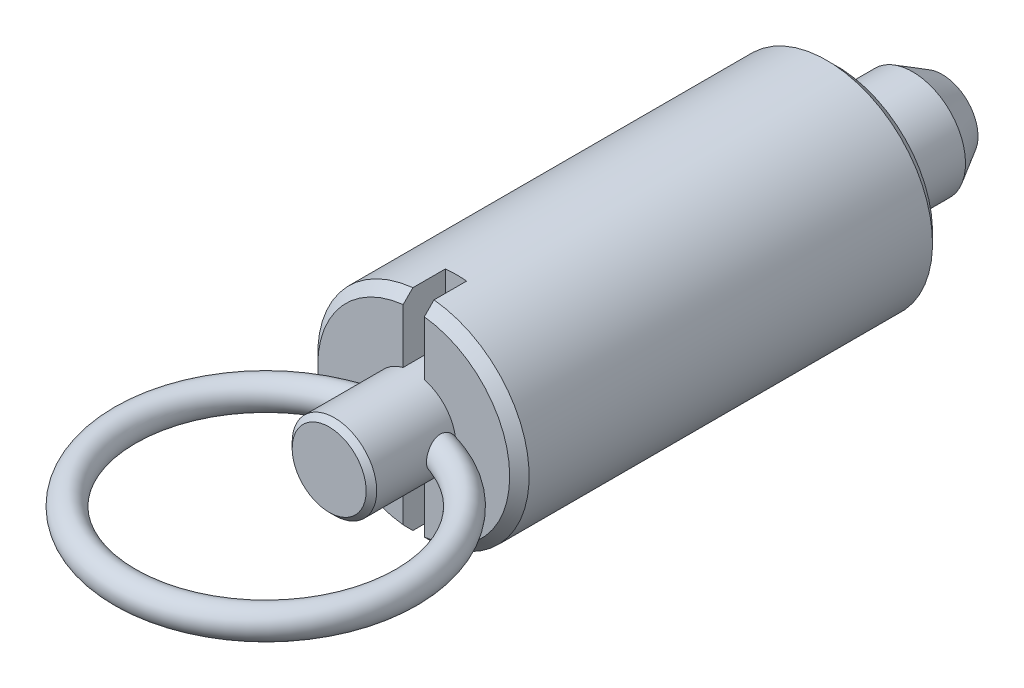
ISO-10303-21;
HEADER;
FILE_DESCRIPTION(('STEP AP214'),'2;1');
FILE_NAME('part.step','',(''),(''),'','','');
FILE_SCHEMA(('AUTOMOTIVE_DESIGN { 1 0 10303 214 1 1 1 1 }'));
ENDSEC;
DATA;
#1=APPLICATION_CONTEXT('core data for automotive mechanical design processes');
#2=APPLICATION_PROTOCOL_DEFINITION('international standard','automotive_design',2000,#1);
#3=PRODUCT_CONTEXT('',#1,'mechanical');
#4=PRODUCT('Part','Part','',(#3));
#5=PRODUCT_RELATED_PRODUCT_CATEGORY('part','',(#4));
#6=PRODUCT_DEFINITION_FORMATION('','',#4);
#7=PRODUCT_DEFINITION_CONTEXT('part definition',#1,'design');
#8=PRODUCT_DEFINITION('design','',#6,#7);
#9=PRODUCT_DEFINITION_SHAPE('','',#8);
#10=(LENGTH_UNIT() NAMED_UNIT(*) SI_UNIT(.MILLI.,.METRE.));
#11=(NAMED_UNIT(*) PLANE_ANGLE_UNIT() SI_UNIT($,.RADIAN.));
#12=(NAMED_UNIT(*) SI_UNIT($,.STERADIAN.) SOLID_ANGLE_UNIT());
#13=UNCERTAINTY_MEASURE_WITH_UNIT(LENGTH_MEASURE(1.E-05),#10,'distance_accuracy_value','');
#14=(GEOMETRIC_REPRESENTATION_CONTEXT(3) GLOBAL_UNCERTAINTY_ASSIGNED_CONTEXT((#13)) GLOBAL_UNIT_ASSIGNED_CONTEXT((#10,
#11,#12)) REPRESENTATION_CONTEXT('',''));
#15=CARTESIAN_POINT('',(0.,0.,0.));
#16=DIRECTION('',(0.,0.,1.));
#17=DIRECTION('',(1.,0.,0.));
#18=AXIS2_PLACEMENT_3D('',#15,#16,#17);
#19=CARTESIAN_POINT('',(3.38341924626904,0.,-10.));
#20=DIRECTION('',(0.,0.,1.));
#21=DIRECTION('',(0.,-1.,0.));
#22=AXIS2_PLACEMENT_3D('',#19,#20,#21);
#23=PLANE('',#22);
#24=CARTESIAN_POINT('',(0.,0.,-9.99999999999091));
#25=DIRECTION('',(0.,0.,1.));
#26=DIRECTION('',(0.,-1.,0.));
#27=AXIS2_PLACEMENT_3D('',#24,#25,#26);
#28=CIRCLE('',#27,3.3834192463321);
#29=CARTESIAN_POINT('',(0.,-3.3834192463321,-9.99999999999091));
#30=VERTEX_POINT('',#29);
#31=EDGE_CURVE('E294',#30,#30,#28,.T.);
#32=ORIENTED_EDGE('',*,*,#31,.F.);
#33=EDGE_LOOP('',(#32));
#34=FACE_BOUND('',#33,.T.);
#35=ADVANCED_FACE('F14',(#34),#23,.F.);
#36=CARTESIAN_POINT('',(0.,0.,-7.20000000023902));
#37=DIRECTION('',(0.,0.,1.));
#38=DIRECTION('',(0.,-1.,0.));
#39=AXIS2_PLACEMENT_3D('',#36,#37,#38);
#40=CONICAL_SURFACE('',#39,4.99999999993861,0.523598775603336);
#41=CARTESIAN_POINT('',(0.,0.,-7.2));
#42=DIRECTION('',(0.,0.,1.));
#43=DIRECTION('',(0.,-1.,0.));
#44=AXIS2_PLACEMENT_3D('',#41,#42,#43);
#45=CIRCLE('',#44,5.);
#46=CARTESIAN_POINT('',(0.,-5.,-7.2));
#47=VERTEX_POINT('',#46);
#48=EDGE_CURVE('E338',#47,#47,#45,.T.);
#49=ORIENTED_EDGE('',*,*,#48,.F.);
#50=EDGE_LOOP('',(#49));
#51=FACE_BOUND('',#50,.T.);
#52=ORIENTED_EDGE('',*,*,#31,.T.);
#53=EDGE_LOOP('',(#52));
#54=FACE_BOUND('',#53,.T.);
#55=ADVANCED_FACE('F198',(#51,#54),#40,.T.);
#56=CARTESIAN_POINT('',(0.,0.,-10.));
#57=DIRECTION('',(0.,0.,1.));
#58=DIRECTION('',(0.,-1.,0.));
#59=AXIS2_PLACEMENT_3D('',#56,#57,#58);
#60=CYLINDRICAL_SURFACE('',#59,5.);
#61=CARTESIAN_POINT('',(0.,0.,0.));
#62=DIRECTION('',(0.,0.,1.));
#63=DIRECTION('',(0.,-1.,0.));
#64=AXIS2_PLACEMENT_3D('',#61,#62,#63);
#65=CIRCLE('',#64,5.);
#66=CARTESIAN_POINT('',(0.,-5.,0.));
#67=VERTEX_POINT('',#66);
#68=EDGE_CURVE('E335',#67,#67,#65,.F.);
#69=ORIENTED_EDGE('',*,*,#68,.T.);
#70=EDGE_LOOP('',(#69));
#71=FACE_BOUND('',#70,.T.);
#72=ORIENTED_EDGE('',*,*,#48,.T.);
#73=EDGE_LOOP('',(#72));
#74=FACE_BOUND('',#73,.T.);
#75=ADVANCED_FACE('F194',(#71,#74),#60,.T.);
#76=CARTESIAN_POINT('',(9.08,0.,0.));
#77=DIRECTION('',(0.,0.,1.));
#78=DIRECTION('',(0.,-1.,0.));
#79=AXIS2_PLACEMENT_3D('',#76,#77,#78);
#80=PLANE('',#79);
#81=CARTESIAN_POINT('',(0.,0.,0.));
#82=DIRECTION('',(0.,0.,1.));
#83=DIRECTION('',(0.,-1.,0.));
#84=AXIS2_PLACEMENT_3D('',#81,#82,#83);
#85=CIRCLE('',#84,9.08);
#86=CARTESIAN_POINT('',(0.,-9.08,0.));
#87=VERTEX_POINT('',#86);
#88=EDGE_CURVE('E24',#87,#87,#85,.T.);
#89=ORIENTED_EDGE('',*,*,#88,.F.);
#90=EDGE_LOOP('',(#89));
#91=FACE_BOUND('',#90,.T.);
#92=ORIENTED_EDGE('',*,*,#68,.F.);
#93=EDGE_LOOP('',(#92));
#94=FACE_BOUND('',#93,.T.);
#95=ADVANCED_FACE('F187',(#91,#94),#80,.F.);
#96=CARTESIAN_POINT('',(0.,0.,0.920000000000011));
#97=DIRECTION('',(0.,0.,1.));
#98=DIRECTION('',(0.,-1.,0.));
#99=AXIS2_PLACEMENT_3D('',#96,#97,#98);
#100=CONICAL_SURFACE('',#99,10.,0.785398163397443);
#101=CARTESIAN_POINT('',(0.,0.,0.920000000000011));
#102=DIRECTION('',(0.,0.,1.));
#103=DIRECTION('',(0.,-1.,0.));
#104=AXIS2_PLACEMENT_3D('',#101,#102,#103);
#105=CIRCLE('',#104,10.);
#106=CARTESIAN_POINT('',(0.,-10.,0.920000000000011));
#107=VERTEX_POINT('',#106);
#108=EDGE_CURVE('E9',#107,#107,#105,.T.);
#109=ORIENTED_EDGE('',*,*,#108,.F.);
#110=EDGE_LOOP('',(#109));
#111=FACE_BOUND('',#110,.T.);
#112=ORIENTED_EDGE('',*,*,#88,.T.);
#113=EDGE_LOOP('',(#112));
#114=FACE_BOUND('',#113,.T.);
#115=ADVANCED_FACE('F178',(#111,#114),#100,.T.);
#116=CARTESIAN_POINT('',(0.,0.,-10.));
#117=DIRECTION('',(0.,0.,1.));
#118=DIRECTION('',(0.,-1.,0.));
#119=AXIS2_PLACEMENT_3D('',#116,#117,#118);
#120=CYLINDRICAL_SURFACE('',#119,10.);
#121=ORIENTED_EDGE('',*,*,#108,.T.);
#122=EDGE_LOOP('',(#121));
#123=FACE_BOUND('',#122,.T.);
#124=DIRECTION('',(0.,0.,1.));
#125=VECTOR('',#124,1.);
#126=CARTESIAN_POINT('',(-1.,9.9498743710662,-10.));
#127=LINE('',#126,#125);
#128=CARTESIAN_POINT('',(-1.,9.9498743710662,39.08));
#129=VERTEX_POINT('',#128);
#130=CARTESIAN_POINT('',(-1.,9.9498743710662,36.));
#131=VERTEX_POINT('',#130);
#132=EDGE_CURVE('E300',#129,#131,#127,.F.);
#133=ORIENTED_EDGE('',*,*,#132,.T.);
#134=CARTESIAN_POINT('',(0.,0.,36.));
#135=DIRECTION('',(0.,0.,1.));
#136=DIRECTION('',(0.,-1.,0.));
#137=AXIS2_PLACEMENT_3D('',#134,#135,#136);
#138=CIRCLE('',#137,10.);
#139=CARTESIAN_POINT('',(1.,9.9498743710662,36.));
#140=VERTEX_POINT('',#139);
#141=EDGE_CURVE('E293',#131,#140,#138,.F.);
#142=ORIENTED_EDGE('',*,*,#141,.T.);
#143=DIRECTION('',(0.,0.,1.));
#144=VECTOR('',#143,1.);
#145=CARTESIAN_POINT('',(1.,9.9498743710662,-10.));
#146=LINE('',#145,#144);
#147=CARTESIAN_POINT('',(1.,9.9498743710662,39.08));
#148=VERTEX_POINT('',#147);
#149=EDGE_CURVE('E283',#140,#148,#146,.T.);
#150=ORIENTED_EDGE('',*,*,#149,.T.);
#151=CARTESIAN_POINT('',(0.,0.,39.08));
#152=DIRECTION('',(0.,0.,1.));
#153=DIRECTION('',(0.,-1.,0.));
#154=AXIS2_PLACEMENT_3D('',#151,#152,#153);
#155=CIRCLE('',#154,10.);
#156=CARTESIAN_POINT('',(1.,-9.9498743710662,39.08));
#157=VERTEX_POINT('',#156);
#158=EDGE_CURVE('E286',#148,#157,#155,.F.);
#159=ORIENTED_EDGE('',*,*,#158,.T.);
#160=DIRECTION('',(0.,0.,1.));
#161=VECTOR('',#160,1.);
#162=CARTESIAN_POINT('',(1.,-9.9498743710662,-10.));
#163=LINE('',#162,#161);
#164=CARTESIAN_POINT('',(1.,-9.9498743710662,36.));
#165=VERTEX_POINT('',#164);
#166=EDGE_CURVE('E289',#157,#165,#163,.F.);
#167=ORIENTED_EDGE('',*,*,#166,.T.);
#168=CARTESIAN_POINT('',(0.,0.,36.));
#169=DIRECTION('',(0.,0.,1.));
#170=DIRECTION('',(0.,-1.,0.));
#171=AXIS2_PLACEMENT_3D('',#168,#169,#170);
#172=CIRCLE('',#171,10.);
#173=CARTESIAN_POINT('',(-1.,-9.9498743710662,36.));
#174=VERTEX_POINT('',#173);
#175=EDGE_CURVE('E308',#165,#174,#172,.F.);
#176=ORIENTED_EDGE('',*,*,#175,.T.);
#177=DIRECTION('',(0.,0.,1.));
#178=VECTOR('',#177,1.);
#179=CARTESIAN_POINT('',(-1.,-9.9498743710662,-10.));
#180=LINE('',#179,#178);
#181=CARTESIAN_POINT('',(-1.,-9.9498743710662,39.08));
#182=VERTEX_POINT('',#181);
#183=EDGE_CURVE('E305',#174,#182,#180,.T.);
#184=ORIENTED_EDGE('',*,*,#183,.T.);
#185=CARTESIAN_POINT('',(0.,0.,39.08));
#186=DIRECTION('',(0.,0.,1.));
#187=DIRECTION('',(0.,-1.,0.));
#188=AXIS2_PLACEMENT_3D('',#185,#186,#187);
#189=CIRCLE('',#188,10.);
#190=EDGE_CURVE('E302',#182,#129,#189,.F.);
#191=ORIENTED_EDGE('',*,*,#190,.T.);
#192=EDGE_LOOP('',(#133,#142,#150,#159,#167,#176,#184,#191));
#193=FACE_BOUND('',#192,.T.);
#194=ADVANCED_FACE('F176',(#123,#193),#120,.T.);
#195=CARTESIAN_POINT('',(0.,0.,48.));
#196=DIRECTION('',(0.,0.,-1.));
#197=DIRECTION('',(0.,1.,0.));
#198=AXIS2_PLACEMENT_3D('',#195,#196,#197);
#199=PLANE('',#198);
#200=CARTESIAN_POINT('',(0.,0.,47.999999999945));
#201=DIRECTION('',(0.,0.,-1.));
#202=DIRECTION('',(0.,1.,0.));
#203=AXIS2_PLACEMENT_3D('',#200,#201,#202);
#204=CIRCLE('',#203,3.49999999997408);
#205=CARTESIAN_POINT('',(0.,3.49999999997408,47.999999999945));
#206=VERTEX_POINT('',#205);
#207=EDGE_CURVE('E18',#206,#206,#204,.T.);
#208=ORIENTED_EDGE('',*,*,#207,.F.);
#209=EDGE_LOOP('',(#208));
#210=FACE_BOUND('',#209,.T.);
#211=ADVANCED_FACE('F16',(#210),#199,.F.);
#212=CARTESIAN_POINT('',(0.,0.,47.4999999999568));
#213=DIRECTION('',(0.,0.,-1.));
#214=DIRECTION('',(0.,1.,0.));
#215=AXIS2_PLACEMENT_3D('',#212,#213,#214);
#216=CONICAL_SURFACE('',#215,3.99999999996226,0.785398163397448);
#217=ORIENTED_EDGE('',*,*,#207,.T.);
#218=EDGE_LOOP('',(#217));
#219=FACE_BOUND('',#218,.T.);
#220=CARTESIAN_POINT('',(0.,0.,47.5));
#221=DIRECTION('',(0.,0.,1.));
#222=DIRECTION('',(0.,-1.,0.));
#223=AXIS2_PLACEMENT_3D('',#220,#221,#222);
#224=CIRCLE('',#223,4.);
#225=CARTESIAN_POINT('',(0.,-4.,47.5));
#226=VERTEX_POINT('',#225);
#227=EDGE_CURVE('E318',#226,#226,#224,.F.);
#228=ORIENTED_EDGE('',*,*,#227,.F.);
#229=EDGE_LOOP('',(#228));
#230=FACE_BOUND('',#229,.T.);
#231=ADVANCED_FACE('F168',(#219,#230),#216,.T.);
#232=CARTESIAN_POINT('',(0.,0.,54.));
#233=DIRECTION('',(0.,-1.,0.));
#234=DIRECTION('',(1.,0.,0.));
#235=AXIS2_PLACEMENT_3D('',#232,#233,#234);
#236=TOROIDAL_SURFACE('',#235,13.3,1.4);
#237=CARTESIAN_POINT('',(3.9488119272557,-0.637874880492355,40.));
#238=CARTESIAN_POINT('',(3.94322786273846,-0.672455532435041,40.0168158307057));
#239=CARTESIAN_POINT('',(3.937294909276,-0.706284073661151,40.0350207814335));
#240=CARTESIAN_POINT('',(3.92489096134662,-0.77223996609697,40.0741323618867));
#241=CARTESIAN_POINT('',(3.91841993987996,-0.804367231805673,40.095039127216));
#242=CARTESIAN_POINT('',(3.89844450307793,-0.897876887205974,40.1616805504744));
#243=CARTESIAN_POINT('',(3.88437399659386,-0.956409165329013,40.2113470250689));
#244=CARTESIAN_POINT('',(3.85626395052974,-1.06411656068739,40.3200528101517));
#245=CARTESIAN_POINT('',(3.84222446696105,-1.11328057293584,40.3791030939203));
#246=CARTESIAN_POINT('',(3.81579918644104,-1.20073621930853,40.5050461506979));
#247=CARTESIAN_POINT('',(3.80341192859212,-1.23903749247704,40.5719318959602));
#248=CARTESIAN_POINT('',(3.78195814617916,-1.30304059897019,40.7101534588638));
#249=CARTESIAN_POINT('',(3.77282488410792,-1.32899981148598,40.7813598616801));
#250=CARTESIAN_POINT('',(3.75847545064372,-1.36905787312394,40.9274161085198));
#251=CARTESIAN_POINT('',(3.75326002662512,-1.38315445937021,41.0022666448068));
#252=CARTESIAN_POINT('',(3.74720005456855,-1.39948791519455,41.1527986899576));
#253=CARTESIAN_POINT('',(3.74632149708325,-1.40181706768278,41.2284690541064));
#254=CARTESIAN_POINT('',(3.74871289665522,-1.39540645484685,41.3792488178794));
#255=CARTESIAN_POINT('',(3.75198369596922,-1.38666444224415,41.4543581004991));
#256=CARTESIAN_POINT('',(3.76251368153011,-1.35784465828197,41.6079255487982));
#257=CARTESIAN_POINT('',(3.77005339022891,-1.33696647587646,41.6862128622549));
#258=CARTESIAN_POINT('',(3.78831750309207,-1.28429837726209,41.8386592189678));
#259=CARTESIAN_POINT('',(3.79904448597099,-1.25249962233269,41.9128148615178));
#260=CARTESIAN_POINT('',(3.82400679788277,-1.17424972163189,42.064450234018));
#261=CARTESIAN_POINT('',(3.83851215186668,-1.12647119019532,42.1412032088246));
#262=CARTESIAN_POINT('',(3.86841228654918,-1.01906270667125,42.28573989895));
#263=CARTESIAN_POINT('',(3.88380688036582,-0.95943523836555,42.3535254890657));
#264=CARTESIAN_POINT('',(3.91165351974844,-0.838030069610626,42.4692426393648));
#265=CARTESIAN_POINT('',(3.92422005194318,-0.777661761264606,42.5186216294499));
#266=CARTESIAN_POINT('',(3.94747371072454,-0.649376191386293,42.6069802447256));
#267=CARTESIAN_POINT('',(3.95816190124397,-0.581463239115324,42.6459657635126));
#268=CARTESIAN_POINT('',(3.9765257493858,-0.4386995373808,42.7116218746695));
#269=CARTESIAN_POINT('',(3.98417336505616,-0.363791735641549,42.7381782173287));
#270=CARTESIAN_POINT('',(3.99522574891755,-0.209958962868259,42.7762522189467));
#271=CARTESIAN_POINT('',(3.99863623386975,-0.131039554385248,42.7877901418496));
#272=CARTESIAN_POINT('',(4.00053630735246,0.0153712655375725,42.7942304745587));
#273=CARTESIAN_POINT('',(3.9996994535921,0.0827621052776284,42.7914097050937));
#274=CARTESIAN_POINT('',(3.99472096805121,0.215972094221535,42.7744594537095));
#275=CARTESIAN_POINT('',(3.99057930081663,0.281791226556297,42.760329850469));
#276=CARTESIAN_POINT('',(3.97967069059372,0.407498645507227,42.7224739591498));
#277=CARTESIAN_POINT('',(3.97301283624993,0.46751823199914,42.6991448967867));
#278=CARTESIAN_POINT('',(3.95766253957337,0.583380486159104,42.6440739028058));
#279=CARTESIAN_POINT('',(3.94896621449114,0.639214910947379,42.6123159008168));
#280=CARTESIAN_POINT('',(3.92902398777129,0.752660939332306,42.5371341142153));
#281=CARTESIAN_POINT('',(3.91759447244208,0.809594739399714,42.4927401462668));
#282=CARTESIAN_POINT('',(3.89398949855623,0.916428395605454,42.3964778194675));
#283=CARTESIAN_POINT('',(3.88181448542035,0.966332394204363,42.3446138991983));
#284=CARTESIAN_POINT('',(3.85539880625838,1.06728707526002,42.2245292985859));
#285=CARTESIAN_POINT('',(3.84119019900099,1.11685961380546,42.1550548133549));
#286=CARTESIAN_POINT('',(3.81445536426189,1.20501269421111,42.0091030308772));
#287=CARTESIAN_POINT('',(3.80193056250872,1.24358395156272,41.9326198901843));
#288=CARTESIAN_POINT('',(3.7788857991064,1.31204441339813,41.7664088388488));
#289=CARTESIAN_POINT('',(3.76868702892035,1.34069621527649,41.6761192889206));
#290=CARTESIAN_POINT('',(3.75372905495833,1.38203334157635,41.4915073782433));
#291=CARTESIAN_POINT('',(3.74896601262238,1.39472993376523,41.3971879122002));
#292=CARTESIAN_POINT('',(3.74612830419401,1.40233303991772,41.214422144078));
#293=CARTESIAN_POINT('',(3.74760132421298,1.39844250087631,41.1260361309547));
#294=CARTESIAN_POINT('',(3.75635673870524,1.37475301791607,40.9517320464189));
#295=CARTESIAN_POINT('',(3.76363372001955,1.35496889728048,40.8658117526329));
#296=CARTESIAN_POINT('',(3.78192275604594,1.3029616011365,40.7097742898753));
#297=CARTESIAN_POINT('',(3.79238394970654,1.27250930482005,40.6389961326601));
#298=CARTESIAN_POINT('',(3.81591349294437,1.20010267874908,40.5040386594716));
#299=CARTESIAN_POINT('',(3.8289823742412,1.1581460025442,40.439860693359));
#300=CARTESIAN_POINT('',(3.85584763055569,1.06522751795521,40.3215006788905));
#301=CARTESIAN_POINT('',(3.86961467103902,1.01454073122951,40.2670947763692));
#302=CARTESIAN_POINT('',(3.8967252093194,0.904825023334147,40.1674301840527));
#303=CARTESIAN_POINT('',(3.91006919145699,0.845806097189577,40.1221606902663));
#304=CARTESIAN_POINT('',(3.92719663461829,0.760066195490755,40.0668296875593));
#305=CARTESIAN_POINT('',(3.93174516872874,0.736200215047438,40.052439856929));
#306=CARTESIAN_POINT('',(3.9405266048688,0.687645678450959,40.0251255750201));
#307=CARTESIAN_POINT('',(3.94476005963,0.66295867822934,40.0121985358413));
#308=CARTESIAN_POINT('',(3.94881192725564,0.637874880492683,40.));
#309=B_SPLINE_CURVE_WITH_KNOTS('',3,(#237,#238,#239,#240,#241,#242,#243,#244,#245,#246,#247,
#248,#249,#250,#251,#252,#253,#254,#255,#256,#257,#258,#259,#260,#261,#262,#263,#264,#265,#266,
#267,#268,#269,#270,#271,#272,#273,#274,#275,#276,#277,#278,#279,#280,#281,#282,#283,#284,#285,
#286,#287,#288,#289,#290,#291,#292,#293,#294,#295,#296,#297,#298,#299,#300,#301,#302,#303,#304,
#305,#306,#307,#308),.UNSPECIFIED.,.F.,.F.,(4,2,2,2,2,2,2,2,2,2,2,2,2,2,2,2,2,2,2,2,2,2,2,2,2,2,
2,2,2,2,2,2,2,2,2,4),(0.,0.116497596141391,0.233001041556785,0.465934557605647,
0.699142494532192,0.932142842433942,1.16004429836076,1.38798921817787,1.61414373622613,
1.8403441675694,2.08349615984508,2.32684541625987,2.60034937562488,2.8737960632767,
3.10984475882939,3.34575931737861,3.58380177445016,3.82152271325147,4.02284189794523,
4.22416324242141,4.41760551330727,4.61141927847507,4.8298934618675,5.04823836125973,
5.30675344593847,5.56548606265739,5.84983071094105,6.13397443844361,6.39787543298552,
6.66153058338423,6.893649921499,7.12581663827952,7.35168815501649,7.57729098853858,
7.66196308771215,7.7464829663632),.UNSPECIFIED.);
#310=CARTESIAN_POINT('',(3.94881192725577,-0.637874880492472,40.));
#311=VERTEX_POINT('',#310);
#312=CARTESIAN_POINT('',(3.94881192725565,0.637874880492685,40.));
#313=VERTEX_POINT('',#312);
#314=EDGE_CURVE('E107',#311,#313,#309,.T.);
#315=ORIENTED_EDGE('',*,*,#314,.F.);
#316=CARTESIAN_POINT('',(3.94881192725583,-0.637874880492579,40.));
#317=CARTESIAN_POINT('',(3.97223986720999,-0.6254437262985,40.));
#318=CARTESIAN_POINT('',(3.99544574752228,-0.61258031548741,40.));
#319=CARTESIAN_POINT('',(4.04131714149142,-0.585861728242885,40.));
#320=CARTESIAN_POINT('',(4.06398193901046,-0.572005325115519,40.));
#321=CARTESIAN_POINT('',(4.10903594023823,-0.542932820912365,40.));
#322=CARTESIAN_POINT('',(4.13141190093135,-0.527696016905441,40.));
#323=CARTESIAN_POINT('',(4.17523615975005,-0.495961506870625,40.));
#324=CARTESIAN_POINT('',(4.19668486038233,-0.479464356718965,40.));
#325=CARTESIAN_POINT('',(4.25257429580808,-0.433385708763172,40.));
#326=CARTESIAN_POINT('',(4.28597529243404,-0.402509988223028,40.));
#327=CARTESIAN_POINT('',(4.34756404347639,-0.336121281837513,40.));
#328=CARTESIAN_POINT('',(4.37578442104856,-0.300639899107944,40.));
#329=CARTESIAN_POINT('',(4.41486589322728,-0.239266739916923,40.));
#330=CARTESIAN_POINT('',(4.42821886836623,-0.214976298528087,40.));
#331=CARTESIAN_POINT('',(4.45101779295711,-0.164598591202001,40.));
#332=CARTESIAN_POINT('',(4.46046601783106,-0.138512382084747,40.));
#333=CARTESIAN_POINT('',(4.47461909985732,-0.0847744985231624,40.));
#334=CARTESIAN_POINT('',(4.47927667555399,-0.0571100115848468,40.));
#335=CARTESIAN_POINT('',(4.48309157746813,-0.00140475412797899,40.));
#336=CARTESIAN_POINT('',(4.48225217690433,0.0266357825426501,40.));
#337=CARTESIAN_POINT('',(4.47564186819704,0.0785680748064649,40.));
#338=CARTESIAN_POINT('',(4.47049448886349,0.102543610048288,40.));
#339=CARTESIAN_POINT('',(4.45655028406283,0.149428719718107,40.));
#340=CARTESIAN_POINT('',(4.44774832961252,0.1723367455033,40.));
#341=CARTESIAN_POINT('',(4.42985504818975,0.210874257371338,40.));
#342=CARTESIAN_POINT('',(4.42145047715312,0.226831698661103,40.));
#343=CARTESIAN_POINT('',(4.40326927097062,0.257920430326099,40.));
#344=CARTESIAN_POINT('',(4.39349385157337,0.273052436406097,40.));
#345=CARTESIAN_POINT('',(4.36238351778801,0.31730962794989,40.));
#346=CARTESIAN_POINT('',(4.33930469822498,0.345214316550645,40.));
#347=CARTESIAN_POINT('',(4.29307969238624,0.39466838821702,40.));
#348=CARTESIAN_POINT('',(4.27030419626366,0.416575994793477,40.));
#349=CARTESIAN_POINT('',(4.22294658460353,0.458362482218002,40.));
#350=CARTESIAN_POINT('',(4.19836307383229,0.478239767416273,40.));
#351=CARTESIAN_POINT('',(4.12259295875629,0.535222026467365,40.));
#352=CARTESIAN_POINT('',(4.06939732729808,0.569666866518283,40.));
#353=CARTESIAN_POINT('',(4.0038324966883,0.607656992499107,40.));
#354=CARTESIAN_POINT('',(3.99289036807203,0.613853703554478,40.));
#355=CARTESIAN_POINT('',(3.97092109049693,0.626023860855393,40.));
#356=CARTESIAN_POINT('',(3.95989424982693,0.631997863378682,40.));
#357=CARTESIAN_POINT('',(3.94881192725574,0.637874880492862,40.));
#358=B_SPLINE_CURVE_WITH_KNOTS('',3,(#316,#317,#318,#319,#320,#321,#322,#323,#324,#325,#326,
#327,#328,#329,#330,#331,#332,#333,#334,#335,#336,#337,#338,#339,#340,#341,#342,#343,#344,#345,
#346,#347,#348,#349,#350,#351,#352,#353,#354,#355,#356,#357),.UNSPECIFIED.,.F.,.F.,(4,2,2,2,2,2,
2,2,2,2,2,2,2,2,2,2,2,2,2,2,4),(0.,0.0795699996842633,0.159240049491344,0.240411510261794,
0.321547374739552,0.457636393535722,0.592836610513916,0.675725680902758,0.758566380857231,
0.842217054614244,0.925817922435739,0.999066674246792,1.07241857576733,1.12645167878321,
1.18043716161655,1.28867784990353,1.38335765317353,1.47811130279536,1.66766290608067,
1.7053893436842,1.7430141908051),.UNSPECIFIED.);
#359=EDGE_CURVE('E101',#311,#313,#358,.T.);
#360=ORIENTED_EDGE('',*,*,#359,.T.);
#361=EDGE_LOOP('',(#315,#360));
#362=FACE_BOUND('',#361,.T.);
#363=CARTESIAN_POINT('',(-3.94881192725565,0.637874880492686,40.));
#364=CARTESIAN_POINT('',(-3.97223986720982,0.625443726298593,40.));
#365=CARTESIAN_POINT('',(-3.99544574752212,0.612580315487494,40.));
#366=CARTESIAN_POINT('',(-4.04131714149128,0.585861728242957,40.));
#367=CARTESIAN_POINT('',(-4.06398193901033,0.572005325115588,40.));
#368=CARTESIAN_POINT('',(-4.10903594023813,0.542932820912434,40.));
#369=CARTESIAN_POINT('',(-4.13141190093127,0.527696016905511,40.));
#370=CARTESIAN_POINT('',(-4.17523615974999,0.495961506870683,40.));
#371=CARTESIAN_POINT('',(-4.19668486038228,0.479464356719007,40.));
#372=CARTESIAN_POINT('',(-4.25257429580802,0.433385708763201,40.));
#373=CARTESIAN_POINT('',(-4.28597529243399,0.402509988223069,40.));
#374=CARTESIAN_POINT('',(-4.34756404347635,0.336121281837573,40.));
#375=CARTESIAN_POINT('',(-4.37578442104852,0.300639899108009,40.));
#376=CARTESIAN_POINT('',(-4.41486589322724,0.239266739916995,40.));
#377=CARTESIAN_POINT('',(-4.4282188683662,0.214976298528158,40.));
#378=CARTESIAN_POINT('',(-4.45101779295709,0.164598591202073,40.));
#379=CARTESIAN_POINT('',(-4.46046601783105,0.13851238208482,40.));
#380=CARTESIAN_POINT('',(-4.47461909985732,0.0847744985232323,40.));
#381=CARTESIAN_POINT('',(-4.47927667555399,0.0571100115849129,40.));
#382=CARTESIAN_POINT('',(-4.48309157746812,0.00140475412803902,40.));
#383=CARTESIAN_POINT('',(-4.48225217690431,-0.0266357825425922,40.));
#384=CARTESIAN_POINT('',(-4.47564186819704,-0.0785680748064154,40.));
#385=CARTESIAN_POINT('',(-4.47049448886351,-0.102543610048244,40.));
#386=CARTESIAN_POINT('',(-4.45655028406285,-0.149428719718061,40.));
#387=CARTESIAN_POINT('',(-4.44774832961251,-0.172336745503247,40.));
#388=CARTESIAN_POINT('',(-4.42985504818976,-0.210874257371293,40.));
#389=CARTESIAN_POINT('',(-4.42145047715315,-0.226831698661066,40.));
#390=CARTESIAN_POINT('',(-4.40326927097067,-0.257920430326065,40.));
#391=CARTESIAN_POINT('',(-4.39349385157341,-0.273052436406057,40.));
#392=CARTESIAN_POINT('',(-4.36238351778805,-0.317309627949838,40.));
#393=CARTESIAN_POINT('',(-4.33930469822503,-0.345214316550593,40.));
#394=CARTESIAN_POINT('',(-4.2930796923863,-0.394668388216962,40.));
#395=CARTESIAN_POINT('',(-4.27030419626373,-0.416575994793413,40.));
#396=CARTESIAN_POINT('',(-4.2229465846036,-0.458362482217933,40.));
#397=CARTESIAN_POINT('',(-4.19836307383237,-0.478239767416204,40.));
#398=CARTESIAN_POINT('',(-4.12259295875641,-0.535222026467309,40.));
#399=CARTESIAN_POINT('',(-4.06939732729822,-0.569666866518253,40.));
#400=CARTESIAN_POINT('',(-4.00383249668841,-0.60765699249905,40.));
#401=CARTESIAN_POINT('',(-3.99289036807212,-0.613853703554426,40.));
#402=CARTESIAN_POINT('',(-3.97092109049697,-0.626023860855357,40.));
#403=CARTESIAN_POINT('',(-3.95989424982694,-0.631997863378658,40.));
#404=CARTESIAN_POINT('',(-3.94881192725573,-0.637874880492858,40.));
#405=B_SPLINE_CURVE_WITH_KNOTS('',3,(#363,#364,#365,#366,#367,#368,#369,#370,#371,#372,#373,
#374,#375,#376,#377,#378,#379,#380,#381,#382,#383,#384,#385,#386,#387,#388,#389,#390,#391,#392,
#393,#394,#395,#396,#397,#398,#399,#400,#401,#402,#403,#404),.UNSPECIFIED.,.F.,.F.,(4,2,2,2,2,2,
2,2,2,2,2,2,2,2,2,2,2,2,2,2,4),(0.,0.0795699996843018,0.159240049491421,0.24041151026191,
0.321547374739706,0.457636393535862,0.592836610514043,0.675725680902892,0.75856638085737,
0.842217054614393,0.925817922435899,0.999066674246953,1.07241857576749,1.12645167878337,
1.1804371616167,1.28867784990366,1.38335765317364,1.47811130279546,1.66766290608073,
1.70538934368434,1.74301419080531),.UNSPECIFIED.);
#406=CARTESIAN_POINT('',(-3.94881192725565,0.637874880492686,40.));
#407=VERTEX_POINT('',#406);
#408=CARTESIAN_POINT('',(-3.94881192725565,-0.637874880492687,40.));
#409=VERTEX_POINT('',#408);
#410=EDGE_CURVE('E109',#407,#409,#405,.T.);
#411=ORIENTED_EDGE('',*,*,#410,.T.);
#412=CARTESIAN_POINT('',(-3.94881192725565,0.637874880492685,40.));
#413=CARTESIAN_POINT('',(-3.94322786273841,0.672455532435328,40.0168158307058));
#414=CARTESIAN_POINT('',(-3.93729490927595,0.706284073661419,40.0350207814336));
#415=CARTESIAN_POINT('',(-3.92489096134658,0.77223996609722,40.0741323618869));
#416=CARTESIAN_POINT('',(-3.91841993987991,0.804367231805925,40.0950391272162));
#417=CARTESIAN_POINT('',(-3.89844450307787,0.897876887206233,40.1616805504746));
#418=CARTESIAN_POINT('',(-3.8843739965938,0.956409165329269,40.2113470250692));
#419=CARTESIAN_POINT('',(-3.85626395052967,1.06411656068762,40.3200528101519));
#420=CARTESIAN_POINT('',(-3.84222446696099,1.11328057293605,40.3791030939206));
#421=CARTESIAN_POINT('',(-3.81579918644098,1.20073621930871,40.5050461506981));
#422=CARTESIAN_POINT('',(-3.80341192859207,1.23903749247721,40.5719318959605));
#423=CARTESIAN_POINT('',(-3.78195814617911,1.30304059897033,40.7101534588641));
#424=CARTESIAN_POINT('',(-3.77282488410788,1.32899981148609,40.7813598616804));
#425=CARTESIAN_POINT('',(-3.7584754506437,1.36905787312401,40.9274161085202));
#426=CARTESIAN_POINT('',(-3.75326002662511,1.38315445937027,41.0022666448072));
#427=CARTESIAN_POINT('',(-3.74720005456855,1.39948791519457,41.1527986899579));
#428=CARTESIAN_POINT('',(-3.74632149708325,1.40181706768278,41.2284690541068));
#429=CARTESIAN_POINT('',(-3.74871289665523,1.39540645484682,41.3792488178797));
#430=CARTESIAN_POINT('',(-3.75198369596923,1.3866644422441,41.4543581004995));
#431=CARTESIAN_POINT('',(-3.76251368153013,1.35784465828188,41.6079255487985));
#432=CARTESIAN_POINT('',(-3.77005339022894,1.33696647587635,41.6862128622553));
#433=CARTESIAN_POINT('',(-3.78831750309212,1.28429837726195,41.8386592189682));
#434=CARTESIAN_POINT('',(-3.79904448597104,1.25249962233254,41.9128148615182));
#435=CARTESIAN_POINT('',(-3.82400679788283,1.17424972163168,42.0644502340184));
#436=CARTESIAN_POINT('',(-3.83851215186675,1.12647119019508,42.141203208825));
#437=CARTESIAN_POINT('',(-3.86841228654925,1.01906270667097,42.2857398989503));
#438=CARTESIAN_POINT('',(-3.88380688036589,0.959435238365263,42.353525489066));
#439=CARTESIAN_POINT('',(-3.9116535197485,0.838030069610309,42.4692426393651));
#440=CARTESIAN_POINT('',(-3.92422005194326,0.777661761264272,42.5186216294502));
#441=CARTESIAN_POINT('',(-3.94747371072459,0.64937619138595,42.6069802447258));
#442=CARTESIAN_POINT('',(-3.95816190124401,0.581463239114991,42.6459657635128));
#443=CARTESIAN_POINT('',(-3.97652574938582,0.438699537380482,42.7116218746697));
#444=CARTESIAN_POINT('',(-3.98417336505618,0.363791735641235,42.7381782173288));
#445=CARTESIAN_POINT('',(-3.99522574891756,0.209958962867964,42.7762522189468));
#446=CARTESIAN_POINT('',(-3.99863623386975,0.131039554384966,42.7877901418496));
#447=CARTESIAN_POINT('',(-4.00053630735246,-0.0153712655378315,42.7942304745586));
#448=CARTESIAN_POINT('',(-3.99969945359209,-0.0827621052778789,42.7914097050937));
#449=CARTESIAN_POINT('',(-3.9947209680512,-0.215972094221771,42.7744594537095));
#450=CARTESIAN_POINT('',(-3.99057930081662,-0.281791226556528,42.760329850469));
#451=CARTESIAN_POINT('',(-3.9796706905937,-0.407498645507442,42.7224739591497));
#452=CARTESIAN_POINT('',(-3.9730128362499,-0.467518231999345,42.6991448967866));
#453=CARTESIAN_POINT('',(-3.95766253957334,-0.583380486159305,42.6440739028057));
#454=CARTESIAN_POINT('',(-3.94896621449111,-0.639214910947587,42.6123159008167));
#455=CARTESIAN_POINT('',(-3.92902398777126,-0.752660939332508,42.5371341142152));
#456=CARTESIAN_POINT('',(-3.91759447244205,-0.8095947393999,42.4927401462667));
#457=CARTESIAN_POINT('',(-3.89398949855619,-0.916428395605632,42.3964778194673));
#458=CARTESIAN_POINT('',(-3.8818144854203,-0.966332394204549,42.3446138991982));
#459=CARTESIAN_POINT('',(-3.85539880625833,-1.0672870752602,42.2245292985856));
#460=CARTESIAN_POINT('',(-3.84119019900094,-1.11685961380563,42.1550548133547));
#461=CARTESIAN_POINT('',(-3.81445536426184,-1.20501269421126,42.0091030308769));
#462=CARTESIAN_POINT('',(-3.80193056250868,-1.24358395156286,41.9326198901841));
#463=CARTESIAN_POINT('',(-3.77888579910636,-1.31204441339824,41.7664088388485));
#464=CARTESIAN_POINT('',(-3.76868702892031,-1.34069621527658,41.6761192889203));
#465=CARTESIAN_POINT('',(-3.75372905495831,-1.3820333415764,41.491507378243));
#466=CARTESIAN_POINT('',(-3.74896601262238,-1.39472993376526,41.3971879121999));
#467=CARTESIAN_POINT('',(-3.74612830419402,-1.40233303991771,41.2144221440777));
#468=CARTESIAN_POINT('',(-3.74760132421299,-1.39844250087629,41.1260361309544));
#469=CARTESIAN_POINT('',(-3.75635673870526,-1.37475301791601,40.9517320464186));
#470=CARTESIAN_POINT('',(-3.76363372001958,-1.3549688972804,40.8658117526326));
#471=CARTESIAN_POINT('',(-3.78192275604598,-1.30296160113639,40.7097742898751));
#472=CARTESIAN_POINT('',(-3.79238394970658,-1.27250930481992,40.6389961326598));
#473=CARTESIAN_POINT('',(-3.81591349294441,-1.20010267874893,40.5040386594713));
#474=CARTESIAN_POINT('',(-3.82898237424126,-1.15814600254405,40.4398606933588));
#475=CARTESIAN_POINT('',(-3.85584763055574,-1.06522751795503,40.3215006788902));
#476=CARTESIAN_POINT('',(-3.86961467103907,-1.01454073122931,40.267094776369));
#477=CARTESIAN_POINT('',(-3.89672520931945,-0.904825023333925,40.1674301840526));
#478=CARTESIAN_POINT('',(-3.91006919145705,-0.84580609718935,40.1221606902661));
#479=CARTESIAN_POINT('',(-3.92719663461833,-0.760066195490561,40.0668296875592));
#480=CARTESIAN_POINT('',(-3.93174516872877,-0.736200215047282,40.052439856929));
#481=CARTESIAN_POINT('',(-3.94052660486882,-0.687645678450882,40.0251255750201));
#482=CARTESIAN_POINT('',(-3.94476005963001,-0.662958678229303,40.0121985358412));
#483=CARTESIAN_POINT('',(-3.94881192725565,-0.637874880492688,40.));
#484=B_SPLINE_CURVE_WITH_KNOTS('',3,(#412,#413,#414,#415,#416,#417,#418,#419,#420,#421,#422,
#423,#424,#425,#426,#427,#428,#429,#430,#431,#432,#433,#434,#435,#436,#437,#438,#439,#440,#441,
#442,#443,#444,#445,#446,#447,#448,#449,#450,#451,#452,#453,#454,#455,#456,#457,#458,#459,#460,
#461,#462,#463,#464,#465,#466,#467,#468,#469,#470,#471,#472,#473,#474,#475,#476,#477,#478,#479,
#480,#481,#482,#483),.UNSPECIFIED.,.F.,.F.,(4,2,2,2,2,2,2,2,2,2,2,2,2,2,2,2,2,2,2,2,2,2,2,2,2,2,
2,2,2,2,2,2,2,2,2,4),(0.,0.1164975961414,0.233001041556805,0.465934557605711,0.699142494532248,
0.932142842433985,1.16004429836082,1.38798921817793,1.61414373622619,1.84034416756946,
2.08349615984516,2.32684541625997,2.60034937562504,2.87379606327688,3.10984475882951,
3.34575931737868,3.58380177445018,3.82152271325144,4.02284189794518,4.22416324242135,
4.41760551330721,4.61141927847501,4.82989346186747,5.04823836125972,5.30675344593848,
5.56548606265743,5.84983071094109,6.13397443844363,6.39787543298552,6.66153058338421,
6.89364992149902,7.12581663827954,7.35168815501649,7.57729098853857,7.661963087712,
7.74648296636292),.UNSPECIFIED.);
#485=EDGE_CURVE('E146',#407,#409,#484,.T.);
#486=ORIENTED_EDGE('',*,*,#485,.F.);
#487=EDGE_LOOP('',(#411,#486));
#488=FACE_BOUND('',#487,.T.);
#489=ADVANCED_FACE('F104',(#362,#488),#236,.T.);
#490=CARTESIAN_POINT('',(0.,0.,40.));
#491=DIRECTION('',(0.,0.,-1.));
#492=DIRECTION('',(0.,1.,0.));
#493=AXIS2_PLACEMENT_3D('',#490,#491,#492);
#494=PLANE('',#493);
#495=ORIENTED_EDGE('',*,*,#359,.F.);
#496=CARTESIAN_POINT('',(0.,0.,40.));
#497=DIRECTION('',(0.,0.,1.));
#498=DIRECTION('',(0.,-1.,0.));
#499=AXIS2_PLACEMENT_3D('',#496,#497,#498);
#500=CIRCLE('',#499,4.);
#501=CARTESIAN_POINT('',(1.,-3.87298334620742,40.));
#502=VERTEX_POINT('',#501);
#503=EDGE_CURVE('E122',#502,#311,#500,.T.);
#504=ORIENTED_EDGE('',*,*,#503,.F.);
#505=DIRECTION('',(0.,-1.,0.));
#506=VECTOR('',#505,1.);
#507=CARTESIAN_POINT('',(1.,-20.,40.));
#508=LINE('',#507,#506);
#509=CARTESIAN_POINT('',(1.,-9.02476592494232,40.));
#510=VERTEX_POINT('',#509);
#511=EDGE_CURVE('E265',#510,#502,#508,.F.);
#512=ORIENTED_EDGE('',*,*,#511,.F.);
#513=CARTESIAN_POINT('',(0.,0.,40.));
#514=DIRECTION('',(0.,0.,-1.));
#515=DIRECTION('',(0.,1.,0.));
#516=AXIS2_PLACEMENT_3D('',#513,#514,#515);
#517=CIRCLE('',#516,9.08);
#518=CARTESIAN_POINT('',(1.,9.02476592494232,40.));
#519=VERTEX_POINT('',#518);
#520=EDGE_CURVE('E263',#519,#510,#517,.T.);
#521=ORIENTED_EDGE('',*,*,#520,.F.);
#522=DIRECTION('',(0.,-1.,0.));
#523=VECTOR('',#522,1.);
#524=CARTESIAN_POINT('',(1.,-20.,40.));
#525=LINE('',#524,#523);
#526=CARTESIAN_POINT('',(1.,3.87298334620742,40.));
#527=VERTEX_POINT('',#526);
#528=EDGE_CURVE('E114',#527,#519,#525,.F.);
#529=ORIENTED_EDGE('',*,*,#528,.F.);
#530=CARTESIAN_POINT('',(0.,0.,40.));
#531=DIRECTION('',(0.,0.,1.));
#532=DIRECTION('',(0.,-1.,0.));
#533=AXIS2_PLACEMENT_3D('',#530,#531,#532);
#534=CIRCLE('',#533,4.);
#535=EDGE_CURVE('E111',#313,#527,#534,.T.);
#536=ORIENTED_EDGE('',*,*,#535,.F.);
#537=EDGE_LOOP('',(#495,#504,#512,#521,#529,#536));
#538=FACE_BOUND('',#537,.T.);
#539=ADVANCED_FACE('F112',(#538),#494,.F.);
#540=CARTESIAN_POINT('',(0.,0.,32.));
#541=DIRECTION('',(0.,0.,1.));
#542=DIRECTION('',(0.,-1.,0.));
#543=AXIS2_PLACEMENT_3D('',#540,#541,#542);
#544=CYLINDRICAL_SURFACE('',#543,4.);
#545=ORIENTED_EDGE('',*,*,#227,.T.);
#546=EDGE_LOOP('',(#545));
#547=FACE_BOUND('',#546,.T.);
#548=CARTESIAN_POINT('',(0.,0.,36.));
#549=DIRECTION('',(0.,0.,1.));
#550=DIRECTION('',(0.,-1.,0.));
#551=AXIS2_PLACEMENT_3D('',#548,#549,#550);
#552=CIRCLE('',#551,4.);
#553=CARTESIAN_POINT('',(1.,-3.87298334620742,36.));
#554=VERTEX_POINT('',#553);
#555=CARTESIAN_POINT('',(-1.,-3.87298334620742,36.));
#556=VERTEX_POINT('',#555);
#557=EDGE_CURVE('E236',#554,#556,#552,.F.);
#558=ORIENTED_EDGE('',*,*,#557,.F.);
#559=DIRECTION('',(0.,0.,1.));
#560=VECTOR('',#559,1.);
#561=CARTESIAN_POINT('',(1.,-3.87298334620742,36.));
#562=LINE('',#561,#560);
#563=EDGE_CURVE('E262',#502,#554,#562,.F.);
#564=ORIENTED_EDGE('',*,*,#563,.F.);
#565=ORIENTED_EDGE('',*,*,#503,.T.);
#566=ORIENTED_EDGE('',*,*,#314,.T.);
#567=ORIENTED_EDGE('',*,*,#535,.T.);
#568=DIRECTION('',(0.,0.,1.));
#569=VECTOR('',#568,1.);
#570=CARTESIAN_POINT('',(1.,3.87298334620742,36.));
#571=LINE('',#570,#569);
#572=CARTESIAN_POINT('',(1.,3.87298334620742,36.));
#573=VERTEX_POINT('',#572);
#574=EDGE_CURVE('E316',#573,#527,#571,.T.);
#575=ORIENTED_EDGE('',*,*,#574,.F.);
#576=CARTESIAN_POINT('',(0.,0.,36.));
#577=DIRECTION('',(0.,0.,1.));
#578=DIRECTION('',(0.,-1.,0.));
#579=AXIS2_PLACEMENT_3D('',#576,#577,#578);
#580=CIRCLE('',#579,4.);
#581=CARTESIAN_POINT('',(-1.,3.87298334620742,36.));
#582=VERTEX_POINT('',#581);
#583=EDGE_CURVE('E224',#582,#573,#580,.F.);
#584=ORIENTED_EDGE('',*,*,#583,.F.);
#585=DIRECTION('',(0.,0.,1.));
#586=VECTOR('',#585,1.);
#587=CARTESIAN_POINT('',(-1.,3.87298334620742,40.001));
#588=LINE('',#587,#586);
#589=CARTESIAN_POINT('',(-1.,3.87298334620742,40.));
#590=VERTEX_POINT('',#589);
#591=EDGE_CURVE('E159',#590,#582,#588,.F.);
#592=ORIENTED_EDGE('',*,*,#591,.F.);
#593=CARTESIAN_POINT('',(0.,0.,40.));
#594=DIRECTION('',(0.,0.,1.));
#595=DIRECTION('',(0.,-1.,0.));
#596=AXIS2_PLACEMENT_3D('',#593,#594,#595);
#597=CIRCLE('',#596,4.);
#598=EDGE_CURVE('E117',#590,#407,#597,.T.);
#599=ORIENTED_EDGE('',*,*,#598,.T.);
#600=ORIENTED_EDGE('',*,*,#485,.T.);
#601=CARTESIAN_POINT('',(0.,0.,40.));
#602=DIRECTION('',(0.,0.,1.));
#603=DIRECTION('',(0.,-1.,0.));
#604=AXIS2_PLACEMENT_3D('',#601,#602,#603);
#605=CIRCLE('',#604,4.);
#606=CARTESIAN_POINT('',(-1.,-3.87298334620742,40.));
#607=VERTEX_POINT('',#606);
#608=EDGE_CURVE('E153',#409,#607,#605,.T.);
#609=ORIENTED_EDGE('',*,*,#608,.T.);
#610=DIRECTION('',(0.,0.,1.));
#611=VECTOR('',#610,1.);
#612=CARTESIAN_POINT('',(-1.,-3.87298334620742,40.001));
#613=LINE('',#612,#611);
#614=EDGE_CURVE('E312',#556,#607,#613,.T.);
#615=ORIENTED_EDGE('',*,*,#614,.F.);
#616=EDGE_LOOP('',(#558,#564,#565,#566,#567,#575,#584,#592,#599,#600,#609,#615));
#617=FACE_BOUND('',#616,.T.);
#618=ADVANCED_FACE('F120',(#547,#617),#544,.T.);
#619=CARTESIAN_POINT('',(0.,0.,40.));
#620=DIRECTION('',(0.,0.,-1.));
#621=DIRECTION('',(0.,1.,0.));
#622=AXIS2_PLACEMENT_3D('',#619,#620,#621);
#623=PLANE('',#622);
#624=ORIENTED_EDGE('',*,*,#410,.F.);
#625=ORIENTED_EDGE('',*,*,#598,.F.);
#626=DIRECTION('',(0.,1.,0.));
#627=VECTOR('',#626,1.);
#628=CARTESIAN_POINT('',(-1.,-20.,40.));
#629=LINE('',#628,#627);
#630=CARTESIAN_POINT('',(-1.,9.02476592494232,40.));
#631=VERTEX_POINT('',#630);
#632=EDGE_CURVE('E163',#631,#590,#629,.F.);
#633=ORIENTED_EDGE('',*,*,#632,.F.);
#634=CARTESIAN_POINT('',(0.,0.,40.));
#635=DIRECTION('',(0.,0.,-1.));
#636=DIRECTION('',(0.,1.,0.));
#637=AXIS2_PLACEMENT_3D('',#634,#635,#636);
#638=CIRCLE('',#637,9.08);
#639=CARTESIAN_POINT('',(-1.,-9.02476592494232,40.));
#640=VERTEX_POINT('',#639);
#641=EDGE_CURVE('E226',#640,#631,#638,.T.);
#642=ORIENTED_EDGE('',*,*,#641,.F.);
#643=DIRECTION('',(0.,1.,0.));
#644=VECTOR('',#643,1.);
#645=CARTESIAN_POINT('',(-1.,-20.,40.));
#646=LINE('',#645,#644);
#647=EDGE_CURVE('E235',#607,#640,#646,.F.);
#648=ORIENTED_EDGE('',*,*,#647,.F.);
#649=ORIENTED_EDGE('',*,*,#608,.F.);
#650=EDGE_LOOP('',(#624,#625,#633,#642,#648,#649));
#651=FACE_BOUND('',#650,.T.);
#652=ADVANCED_FACE('F139',(#651),#623,.F.);
#653=CARTESIAN_POINT('',(0.,0.,39.08));
#654=DIRECTION('',(0.,0.,-1.));
#655=DIRECTION('',(0.,1.,0.));
#656=AXIS2_PLACEMENT_3D('',#653,#654,#655);
#657=CONICAL_SURFACE('',#656,10.,0.785398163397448);
#658=CARTESIAN_POINT('',(-1.,-9.9498743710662,39.08));
#659=CARTESIAN_POINT('',(-1.,-9.79573079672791,39.2333747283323));
#660=CARTESIAN_POINT('',(-1.,-9.64156663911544,39.3867287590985));
#661=CARTESIAN_POINT('',(-1.,-9.33319715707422,39.6933954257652));
#662=CARTESIAN_POINT('',(-1.,-9.17899183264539,39.8467080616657));
#663=CARTESIAN_POINT('',(-1.,-9.02476592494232,40.));
#664=B_SPLINE_CURVE_WITH_KNOTS('',3,(#658,#659,#660,#661,#662,#663),.UNSPECIFIED.,.F.,.F.,(4,2,
4),(0.,0.652346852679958,1.30469370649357),.UNSPECIFIED.);
#665=EDGE_CURVE('E228',#182,#640,#664,.T.);
#666=ORIENTED_EDGE('',*,*,#665,.T.);
#667=ORIENTED_EDGE('',*,*,#641,.T.);
#668=CARTESIAN_POINT('',(-1.,9.9498743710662,39.08));
#669=CARTESIAN_POINT('',(-1.,9.79573079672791,39.2333747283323));
#670=CARTESIAN_POINT('',(-1.,9.64156663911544,39.3867287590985));
#671=CARTESIAN_POINT('',(-1.,9.33319715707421,39.6933954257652));
#672=CARTESIAN_POINT('',(-1.,9.17899183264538,39.8467080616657));
#673=CARTESIAN_POINT('',(-1.,9.02476592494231,40.));
#674=B_SPLINE_CURVE_WITH_KNOTS('',3,(#668,#669,#670,#671,#672,#673),.UNSPECIFIED.,.F.,.F.,(4,2,
4),(0.,0.652346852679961,1.30469370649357),.UNSPECIFIED.);
#675=EDGE_CURVE('E216',#129,#631,#674,.T.);
#676=ORIENTED_EDGE('',*,*,#675,.F.);
#677=ORIENTED_EDGE('',*,*,#190,.F.);
#678=EDGE_LOOP('',(#666,#667,#676,#677));
#679=FACE_BOUND('',#678,.T.);
#680=ADVANCED_FACE('F212',(#679),#657,.T.);
#681=CARTESIAN_POINT('',(-1.,-20.,40.001));
#682=DIRECTION('',(1.,0.,0.));
#683=DIRECTION('',(0.,1.,0.));
#684=AXIS2_PLACEMENT_3D('',#681,#682,#683);
#685=PLANE('',#684);
#686=ORIENTED_EDGE('',*,*,#665,.F.);
#687=ORIENTED_EDGE('',*,*,#183,.F.);
#688=DIRECTION('',(0.,1.,0.));
#689=VECTOR('',#688,1.);
#690=CARTESIAN_POINT('',(-1.,-20.,36.));
#691=LINE('',#690,#689);
#692=EDGE_CURVE('E309',#174,#556,#691,.T.);
#693=ORIENTED_EDGE('',*,*,#692,.T.);
#694=ORIENTED_EDGE('',*,*,#614,.T.);
#695=ORIENTED_EDGE('',*,*,#647,.T.);
#696=EDGE_LOOP('',(#686,#687,#693,#694,#695));
#697=FACE_BOUND('',#696,.T.);
#698=ADVANCED_FACE('F238',(#697),#685,.T.);
#699=CARTESIAN_POINT('',(-1.,-20.,36.));
#700=DIRECTION('',(0.,0.,1.));
#701=DIRECTION('',(0.,-1.,0.));
#702=AXIS2_PLACEMENT_3D('',#699,#700,#701);
#703=PLANE('',#702);
#704=ORIENTED_EDGE('',*,*,#692,.F.);
#705=ORIENTED_EDGE('',*,*,#175,.F.);
#706=DIRECTION('',(0.,-1.,0.));
#707=VECTOR('',#706,1.);
#708=CARTESIAN_POINT('',(1.,-20.,36.));
#709=LINE('',#708,#707);
#710=EDGE_CURVE('E261',#165,#554,#709,.F.);
#711=ORIENTED_EDGE('',*,*,#710,.T.);
#712=ORIENTED_EDGE('',*,*,#557,.T.);
#713=EDGE_LOOP('',(#704,#705,#711,#712));
#714=FACE_BOUND('',#713,.T.);
#715=ADVANCED_FACE('F242',(#714),#703,.T.);
#716=CARTESIAN_POINT('',(1.,-20.,36.));
#717=DIRECTION('',(-1.,0.,0.));
#718=DIRECTION('',(0.,-1.,0.));
#719=AXIS2_PLACEMENT_3D('',#716,#717,#718);
#720=PLANE('',#719);
#721=ORIENTED_EDGE('',*,*,#166,.F.);
#722=CARTESIAN_POINT('',(1.,-9.9498743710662,39.08));
#723=CARTESIAN_POINT('',(1.,-9.79573079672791,39.2333747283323));
#724=CARTESIAN_POINT('',(1.,-9.64156663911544,39.3867287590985));
#725=CARTESIAN_POINT('',(1.,-9.33319715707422,39.6933954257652));
#726=CARTESIAN_POINT('',(1.,-9.17899183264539,39.8467080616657));
#727=CARTESIAN_POINT('',(1.,-9.02476592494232,40.));
#728=B_SPLINE_CURVE_WITH_KNOTS('',3,(#722,#723,#724,#725,#726,#727),.UNSPECIFIED.,.F.,.F.,(4,2,
4),(0.,0.652346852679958,1.30469370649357),.UNSPECIFIED.);
#729=EDGE_CURVE('E254',#157,#510,#728,.T.);
#730=ORIENTED_EDGE('',*,*,#729,.T.);
#731=ORIENTED_EDGE('',*,*,#511,.T.);
#732=ORIENTED_EDGE('',*,*,#563,.T.);
#733=ORIENTED_EDGE('',*,*,#710,.F.);
#734=EDGE_LOOP('',(#721,#730,#731,#732,#733));
#735=FACE_BOUND('',#734,.T.);
#736=ADVANCED_FACE('F246',(#735),#720,.T.);
#737=CARTESIAN_POINT('',(0.,0.,39.08));
#738=DIRECTION('',(0.,0.,-1.));
#739=DIRECTION('',(0.,1.,0.));
#740=AXIS2_PLACEMENT_3D('',#737,#738,#739);
#741=CONICAL_SURFACE('',#740,10.,0.785398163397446);
#742=ORIENTED_EDGE('',*,*,#729,.F.);
#743=ORIENTED_EDGE('',*,*,#158,.F.);
#744=CARTESIAN_POINT('',(1.,9.9498743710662,39.08));
#745=CARTESIAN_POINT('',(1.,9.79573079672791,39.2333747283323));
#746=CARTESIAN_POINT('',(1.,9.64156663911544,39.3867287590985));
#747=CARTESIAN_POINT('',(1.,9.33319715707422,39.6933954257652));
#748=CARTESIAN_POINT('',(1.,9.17899183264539,39.8467080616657));
#749=CARTESIAN_POINT('',(1.,9.02476592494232,40.));
#750=B_SPLINE_CURVE_WITH_KNOTS('',3,(#744,#745,#746,#747,#748,#749),.UNSPECIFIED.,.F.,.F.,(4,2,
4),(0.,0.652346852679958,1.30469370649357),.UNSPECIFIED.);
#751=EDGE_CURVE('E266',#148,#519,#750,.T.);
#752=ORIENTED_EDGE('',*,*,#751,.T.);
#753=ORIENTED_EDGE('',*,*,#520,.T.);
#754=EDGE_LOOP('',(#742,#743,#752,#753));
#755=FACE_BOUND('',#754,.T.);
#756=ADVANCED_FACE('F251',(#755),#741,.T.);
#757=CARTESIAN_POINT('',(1.,-20.,36.));
#758=DIRECTION('',(-1.,0.,0.));
#759=DIRECTION('',(0.,-1.,0.));
#760=AXIS2_PLACEMENT_3D('',#757,#758,#759);
#761=PLANE('',#760);
#762=ORIENTED_EDGE('',*,*,#751,.F.);
#763=ORIENTED_EDGE('',*,*,#149,.F.);
#764=DIRECTION('',(0.,-1.,0.));
#765=VECTOR('',#764,1.);
#766=CARTESIAN_POINT('',(1.,-20.,36.));
#767=LINE('',#766,#765);
#768=EDGE_CURVE('E297',#573,#140,#767,.F.);
#769=ORIENTED_EDGE('',*,*,#768,.F.);
#770=ORIENTED_EDGE('',*,*,#574,.T.);
#771=ORIENTED_EDGE('',*,*,#528,.T.);
#772=EDGE_LOOP('',(#762,#763,#769,#770,#771));
#773=FACE_BOUND('',#772,.T.);
#774=ADVANCED_FACE('F207',(#773),#761,.T.);
#775=CARTESIAN_POINT('',(-1.,-20.,36.));
#776=DIRECTION('',(0.,0.,1.));
#777=DIRECTION('',(0.,-1.,0.));
#778=AXIS2_PLACEMENT_3D('',#775,#776,#777);
#779=PLANE('',#778);
#780=ORIENTED_EDGE('',*,*,#768,.T.);
#781=ORIENTED_EDGE('',*,*,#141,.F.);
#782=DIRECTION('',(0.,-1.,0.));
#783=VECTOR('',#782,1.);
#784=CARTESIAN_POINT('',(-1.,-20.,36.));
#785=LINE('',#784,#783);
#786=EDGE_CURVE('E33',#131,#582,#785,.T.);
#787=ORIENTED_EDGE('',*,*,#786,.T.);
#788=ORIENTED_EDGE('',*,*,#583,.T.);
#789=EDGE_LOOP('',(#780,#781,#787,#788));
#790=FACE_BOUND('',#789,.T.);
#791=ADVANCED_FACE('F203',(#790),#779,.T.);
#792=CARTESIAN_POINT('',(-1.,-20.,40.001));
#793=DIRECTION('',(1.,0.,0.));
#794=DIRECTION('',(0.,1.,0.));
#795=AXIS2_PLACEMENT_3D('',#792,#793,#794);
#796=PLANE('',#795);
#797=ORIENTED_EDGE('',*,*,#132,.F.);
#798=ORIENTED_EDGE('',*,*,#675,.T.);
#799=ORIENTED_EDGE('',*,*,#632,.T.);
#800=ORIENTED_EDGE('',*,*,#591,.T.);
#801=ORIENTED_EDGE('',*,*,#786,.F.);
#802=EDGE_LOOP('',(#797,#798,#799,#800,#801));
#803=FACE_BOUND('',#802,.T.);
#804=ADVANCED_FACE('F206',(#803),#796,.T.);
#805=CLOSED_SHELL('',(#35,#55,#75,#95,#115,#194,#211,#231,#489,#539,#618,#652,#680,#698,#715,
#736,#756,#774,#791,#804));
#806=MANIFOLD_SOLID_BREP('B1',#805);
#807=ADVANCED_BREP_SHAPE_REPRESENTATION('',(#18,#806),#14);
#808=SHAPE_DEFINITION_REPRESENTATION(#9,#807);
ENDSEC;
END-ISO-10303-21;
